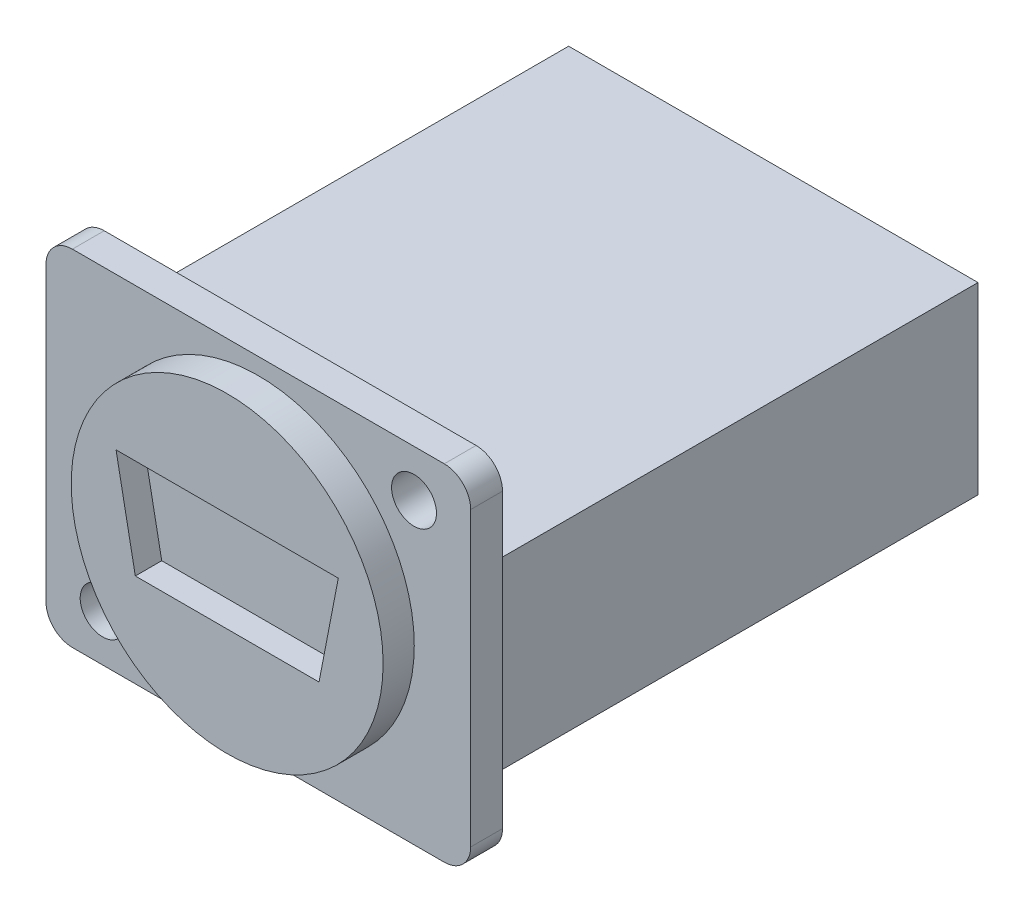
ISO-10303-21;
HEADER;
FILE_DESCRIPTION(('STEP AP214'),'2;1');
FILE_NAME('part.step','',(''),(''),'','','');
FILE_SCHEMA(('AUTOMOTIVE_DESIGN { 1 0 10303 214 1 1 1 1 }'));
ENDSEC;
DATA;
#1=APPLICATION_CONTEXT('core data for automotive mechanical design processes');
#2=APPLICATION_PROTOCOL_DEFINITION('international standard','automotive_design',2000,#1);
#3=PRODUCT_CONTEXT('',#1,'mechanical');
#4=PRODUCT('Part','Part','',(#3));
#5=PRODUCT_RELATED_PRODUCT_CATEGORY('part','',(#4));
#6=PRODUCT_DEFINITION_FORMATION('','',#4);
#7=PRODUCT_DEFINITION_CONTEXT('part definition',#1,'design');
#8=PRODUCT_DEFINITION('design','',#6,#7);
#9=PRODUCT_DEFINITION_SHAPE('','',#8);
#10=(LENGTH_UNIT() NAMED_UNIT(*) SI_UNIT(.MILLI.,.METRE.));
#11=(NAMED_UNIT(*) PLANE_ANGLE_UNIT() SI_UNIT($,.RADIAN.));
#12=(NAMED_UNIT(*) SI_UNIT($,.STERADIAN.) SOLID_ANGLE_UNIT());
#13=UNCERTAINTY_MEASURE_WITH_UNIT(LENGTH_MEASURE(1.E-05),#10,'distance_accuracy_value','');
#14=(GEOMETRIC_REPRESENTATION_CONTEXT(3) GLOBAL_UNCERTAINTY_ASSIGNED_CONTEXT((#13)) GLOBAL_UNIT_ASSIGNED_CONTEXT((#10,
#11,#12)) REPRESENTATION_CONTEXT('',''));
#15=CARTESIAN_POINT('',(0.,0.,0.));
#16=DIRECTION('',(0.,0.,1.));
#17=DIRECTION('',(1.,0.,0.));
#18=AXIS2_PLACEMENT_3D('',#15,#16,#17);
#19=CARTESIAN_POINT('',(-14.08,-11.065,0.));
#20=DIRECTION('',(0.,0.,1.));
#21=DIRECTION('',(1.,0.,0.));
#22=AXIS2_PLACEMENT_3D('',#19,#20,#21);
#23=PLANE('',#22);
#24=CARTESIAN_POINT('',(-14.08,-11.065,0.));
#25=DIRECTION('',(0.,0.,1.));
#26=DIRECTION('',(1.,0.,0.));
#27=AXIS2_PLACEMENT_3D('',#24,#25,#26);
#28=CIRCLE('',#27,2.);
#29=CARTESIAN_POINT('',(-16.08,-11.065,0.));
#30=VERTEX_POINT('',#29);
#31=CARTESIAN_POINT('',(-14.08,-13.065,0.));
#32=VERTEX_POINT('',#31);
#33=EDGE_CURVE('E224',#30,#32,#28,.T.);
#34=ORIENTED_EDGE('',*,*,#33,.F.);
#35=DIRECTION('',(0.,-1.,0.));
#36=VECTOR('',#35,1.);
#37=CARTESIAN_POINT('',(-16.08,11.065,0.));
#38=LINE('',#37,#36);
#39=CARTESIAN_POINT('',(-16.08,11.065,0.));
#40=VERTEX_POINT('',#39);
#41=EDGE_CURVE('E230',#40,#30,#38,.T.);
#42=ORIENTED_EDGE('',*,*,#41,.F.);
#43=CARTESIAN_POINT('',(-14.08,11.065,0.));
#44=DIRECTION('',(0.,0.,1.));
#45=DIRECTION('',(1.,0.,0.));
#46=AXIS2_PLACEMENT_3D('',#43,#44,#45);
#47=CIRCLE('',#46,2.);
#48=CARTESIAN_POINT('',(-14.08,13.065,0.));
#49=VERTEX_POINT('',#48);
#50=EDGE_CURVE('E257',#49,#40,#47,.T.);
#51=ORIENTED_EDGE('',*,*,#50,.F.);
#52=DIRECTION('',(-1.,0.,0.));
#53=VECTOR('',#52,1.);
#54=CARTESIAN_POINT('',(-14.08,13.065,0.));
#55=LINE('',#54,#53);
#56=CARTESIAN_POINT('',(14.08,13.065,0.));
#57=VERTEX_POINT('',#56);
#58=EDGE_CURVE('E255',#57,#49,#55,.T.);
#59=ORIENTED_EDGE('',*,*,#58,.F.);
#60=CARTESIAN_POINT('',(14.08,11.065,0.));
#61=DIRECTION('',(0.,0.,1.));
#62=DIRECTION('',(-1.,0.,0.));
#63=AXIS2_PLACEMENT_3D('',#60,#61,#62);
#64=CIRCLE('',#63,2.);
#65=CARTESIAN_POINT('',(16.08,11.065,0.));
#66=VERTEX_POINT('',#65);
#67=EDGE_CURVE('E253',#66,#57,#64,.T.);
#68=ORIENTED_EDGE('',*,*,#67,.F.);
#69=DIRECTION('',(0.,1.,0.));
#70=VECTOR('',#69,1.);
#71=CARTESIAN_POINT('',(16.08,11.065,0.));
#72=LINE('',#71,#70);
#73=CARTESIAN_POINT('',(16.08,-11.065,0.));
#74=VERTEX_POINT('',#73);
#75=EDGE_CURVE('E251',#74,#66,#72,.T.);
#76=ORIENTED_EDGE('',*,*,#75,.F.);
#77=CARTESIAN_POINT('',(14.08,-11.065,0.));
#78=DIRECTION('',(0.,0.,1.));
#79=DIRECTION('',(1.,0.,0.));
#80=AXIS2_PLACEMENT_3D('',#77,#78,#79);
#81=CIRCLE('',#80,2.);
#82=CARTESIAN_POINT('',(14.08,-13.065,0.));
#83=VERTEX_POINT('',#82);
#84=EDGE_CURVE('E249',#83,#74,#81,.T.);
#85=ORIENTED_EDGE('',*,*,#84,.F.);
#86=DIRECTION('',(1.,0.,0.));
#87=VECTOR('',#86,1.);
#88=CARTESIAN_POINT('',(-14.08,-13.065,0.));
#89=LINE('',#88,#87);
#90=EDGE_CURVE('E247',#32,#83,#89,.T.);
#91=ORIENTED_EDGE('',*,*,#90,.F.);
#92=EDGE_LOOP('',(#34,#42,#51,#59,#68,#76,#85,#91));
#93=FACE_BOUND('',#92,.T.);
#94=CARTESIAN_POINT('',(-11.79,-9.525,0.));
#95=DIRECTION('',(0.,0.,1.));
#96=DIRECTION('',(1.,0.,0.));
#97=AXIS2_PLACEMENT_3D('',#94,#95,#96);
#98=CIRCLE('',#97,1.7);
#99=CARTESIAN_POINT('',(-10.09,-9.525,0.));
#100=VERTEX_POINT('',#99);
#101=EDGE_CURVE('E204',#100,#100,#98,.T.);
#102=ORIENTED_EDGE('',*,*,#101,.T.);
#103=EDGE_LOOP('',(#102));
#104=FACE_BOUND('',#103,.T.);
#105=CARTESIAN_POINT('',(11.79,9.525,0.));
#106=DIRECTION('',(0.,0.,1.));
#107=DIRECTION('',(1.,0.,0.));
#108=AXIS2_PLACEMENT_3D('',#105,#106,#107);
#109=CIRCLE('',#108,1.7);
#110=CARTESIAN_POINT('',(13.49,9.525,0.));
#111=VERTEX_POINT('',#110);
#112=EDGE_CURVE('E211',#111,#111,#109,.T.);
#113=ORIENTED_EDGE('',*,*,#112,.T.);
#114=EDGE_LOOP('',(#113));
#115=FACE_BOUND('',#114,.T.);
#116=DIRECTION('',(0.,-1.,0.));
#117=VECTOR('',#116,1.);
#118=CARTESIAN_POINT('',(15.5,-7.765,0.));
#119=LINE('',#118,#117);
#120=CARTESIAN_POINT('',(15.5,6.165,0.));
#121=VERTEX_POINT('',#120);
#122=CARTESIAN_POINT('',(15.5,-7.765,0.));
#123=VERTEX_POINT('',#122);
#124=EDGE_CURVE('E55',#121,#123,#119,.T.);
#125=ORIENTED_EDGE('',*,*,#124,.F.);
#126=DIRECTION('',(1.,0.,0.));
#127=VECTOR('',#126,1.);
#128=CARTESIAN_POINT('',(-15.5,6.165,0.));
#129=LINE('',#128,#127);
#130=CARTESIAN_POINT('',(-15.5,6.165,0.));
#131=VERTEX_POINT('',#130);
#132=EDGE_CURVE('E59',#131,#121,#129,.T.);
#133=ORIENTED_EDGE('',*,*,#132,.F.);
#134=DIRECTION('',(0.,1.,0.));
#135=VECTOR('',#134,1.);
#136=CARTESIAN_POINT('',(-15.5,-7.765,0.));
#137=LINE('',#136,#135);
#138=CARTESIAN_POINT('',(-15.5,-7.765,0.));
#139=VERTEX_POINT('',#138);
#140=EDGE_CURVE('E584',#139,#131,#137,.T.);
#141=ORIENTED_EDGE('',*,*,#140,.F.);
#142=DIRECTION('',(-1.,0.,0.));
#143=VECTOR('',#142,1.);
#144=CARTESIAN_POINT('',(-15.5,-7.765,0.));
#145=LINE('',#144,#143);
#146=EDGE_CURVE('E590',#123,#139,#145,.T.);
#147=ORIENTED_EDGE('',*,*,#146,.F.);
#148=EDGE_LOOP('',(#125,#133,#141,#147));
#149=FACE_BOUND('',#148,.T.);
#150=ADVANCED_FACE('F39',(#93,#104,#115,#149),#23,.F.);
#151=CARTESIAN_POINT('',(-14.08,-11.065,2.41));
#152=DIRECTION('',(0.,0.,-1.));
#153=DIRECTION('',(-1.,0.,0.));
#154=AXIS2_PLACEMENT_3D('',#151,#152,#153);
#155=CYLINDRICAL_SURFACE('',#154,2.);
#156=ORIENTED_EDGE('',*,*,#33,.T.);
#157=DIRECTION('',(0.,0.,-1.));
#158=VECTOR('',#157,1.);
#159=CARTESIAN_POINT('',(-14.08,-13.065,2.41));
#160=LINE('',#159,#158);
#161=CARTESIAN_POINT('',(-14.08,-13.065,2.41));
#162=VERTEX_POINT('',#161);
#163=EDGE_CURVE('E43',#162,#32,#160,.T.);
#164=ORIENTED_EDGE('',*,*,#163,.F.);
#165=CARTESIAN_POINT('',(-14.08,-11.065,2.41));
#166=DIRECTION('',(0.,0.,1.));
#167=DIRECTION('',(1.,0.,0.));
#168=AXIS2_PLACEMENT_3D('',#165,#166,#167);
#169=CIRCLE('',#168,2.);
#170=CARTESIAN_POINT('',(-16.08,-11.065,2.41));
#171=VERTEX_POINT('',#170);
#172=EDGE_CURVE('E226',#171,#162,#169,.T.);
#173=ORIENTED_EDGE('',*,*,#172,.F.);
#174=DIRECTION('',(0.,0.,-1.));
#175=VECTOR('',#174,1.);
#176=CARTESIAN_POINT('',(-16.08,-11.065,2.41));
#177=LINE('',#176,#175);
#178=EDGE_CURVE('E244',#171,#30,#177,.T.);
#179=ORIENTED_EDGE('',*,*,#178,.T.);
#180=EDGE_LOOP('',(#156,#164,#173,#179));
#181=FACE_BOUND('',#180,.T.);
#182=ADVANCED_FACE('F41',(#181),#155,.T.);
#183=CARTESIAN_POINT('',(-14.08,-13.065,2.41));
#184=DIRECTION('',(0.,1.,0.));
#185=DIRECTION('',(0.,0.,1.));
#186=AXIS2_PLACEMENT_3D('',#183,#184,#185);
#187=PLANE('',#186);
#188=ORIENTED_EDGE('',*,*,#90,.T.);
#189=DIRECTION('',(0.,0.,-1.));
#190=VECTOR('',#189,1.);
#191=CARTESIAN_POINT('',(14.08,-13.065,2.41));
#192=LINE('',#191,#190);
#193=CARTESIAN_POINT('',(14.08,-13.065,2.41));
#194=VERTEX_POINT('',#193);
#195=EDGE_CURVE('E276',#194,#83,#192,.T.);
#196=ORIENTED_EDGE('',*,*,#195,.F.);
#197=DIRECTION('',(1.,0.,0.));
#198=VECTOR('',#197,1.);
#199=CARTESIAN_POINT('',(-14.08,-13.065,2.41));
#200=LINE('',#199,#198);
#201=EDGE_CURVE('E229',#162,#194,#200,.T.);
#202=ORIENTED_EDGE('',*,*,#201,.F.);
#203=ORIENTED_EDGE('',*,*,#163,.T.);
#204=EDGE_LOOP('',(#188,#196,#202,#203));
#205=FACE_BOUND('',#204,.T.);
#206=ADVANCED_FACE('F285',(#205),#187,.F.);
#207=CARTESIAN_POINT('',(14.08,-11.065,2.41));
#208=DIRECTION('',(0.,0.,-1.));
#209=DIRECTION('',(-1.,0.,0.));
#210=AXIS2_PLACEMENT_3D('',#207,#208,#209);
#211=CYLINDRICAL_SURFACE('',#210,2.);
#212=ORIENTED_EDGE('',*,*,#84,.T.);
#213=DIRECTION('',(0.,0.,-1.));
#214=VECTOR('',#213,1.);
#215=CARTESIAN_POINT('',(16.08,-11.065,2.41));
#216=LINE('',#215,#214);
#217=CARTESIAN_POINT('',(16.08,-11.065,2.41));
#218=VERTEX_POINT('',#217);
#219=EDGE_CURVE('E274',#218,#74,#216,.T.);
#220=ORIENTED_EDGE('',*,*,#219,.F.);
#221=CARTESIAN_POINT('',(14.08,-11.065,2.41));
#222=DIRECTION('',(0.,0.,1.));
#223=DIRECTION('',(1.,0.,0.));
#224=AXIS2_PLACEMENT_3D('',#221,#222,#223);
#225=CIRCLE('',#224,2.);
#226=EDGE_CURVE('E232',#194,#218,#225,.T.);
#227=ORIENTED_EDGE('',*,*,#226,.F.);
#228=ORIENTED_EDGE('',*,*,#195,.T.);
#229=EDGE_LOOP('',(#212,#220,#227,#228));
#230=FACE_BOUND('',#229,.T.);
#231=ADVANCED_FACE('F297',(#230),#211,.T.);
#232=CARTESIAN_POINT('',(16.08,11.065,2.41));
#233=DIRECTION('',(-1.,0.,0.));
#234=DIRECTION('',(0.,-1.,0.));
#235=AXIS2_PLACEMENT_3D('',#232,#233,#234);
#236=PLANE('',#235);
#237=ORIENTED_EDGE('',*,*,#75,.T.);
#238=DIRECTION('',(0.,0.,-1.));
#239=VECTOR('',#238,1.);
#240=CARTESIAN_POINT('',(16.08,11.065,2.41));
#241=LINE('',#240,#239);
#242=CARTESIAN_POINT('',(16.08,11.065,2.41));
#243=VERTEX_POINT('',#242);
#244=EDGE_CURVE('E271',#243,#66,#241,.T.);
#245=ORIENTED_EDGE('',*,*,#244,.F.);
#246=DIRECTION('',(0.,1.,0.));
#247=VECTOR('',#246,1.);
#248=CARTESIAN_POINT('',(16.08,11.065,2.41));
#249=LINE('',#248,#247);
#250=EDGE_CURVE('E234',#218,#243,#249,.T.);
#251=ORIENTED_EDGE('',*,*,#250,.F.);
#252=ORIENTED_EDGE('',*,*,#219,.T.);
#253=EDGE_LOOP('',(#237,#245,#251,#252));
#254=FACE_BOUND('',#253,.T.);
#255=ADVANCED_FACE('F300',(#254),#236,.F.);
#256=CARTESIAN_POINT('',(14.08,11.065,2.41));
#257=DIRECTION('',(0.,0.,-1.));
#258=DIRECTION('',(-1.,0.,0.));
#259=AXIS2_PLACEMENT_3D('',#256,#257,#258);
#260=CYLINDRICAL_SURFACE('',#259,2.);
#261=ORIENTED_EDGE('',*,*,#67,.T.);
#262=DIRECTION('',(0.,0.,-1.));
#263=VECTOR('',#262,1.);
#264=CARTESIAN_POINT('',(14.08,13.065,2.41));
#265=LINE('',#264,#263);
#266=CARTESIAN_POINT('',(14.08,13.065,2.41));
#267=VERTEX_POINT('',#266);
#268=EDGE_CURVE('E268',#267,#57,#265,.T.);
#269=ORIENTED_EDGE('',*,*,#268,.F.);
#270=CARTESIAN_POINT('',(14.08,11.065,2.41));
#271=DIRECTION('',(0.,0.,1.));
#272=DIRECTION('',(-1.,0.,0.));
#273=AXIS2_PLACEMENT_3D('',#270,#271,#272);
#274=CIRCLE('',#273,2.);
#275=EDGE_CURVE('E236',#243,#267,#274,.T.);
#276=ORIENTED_EDGE('',*,*,#275,.F.);
#277=ORIENTED_EDGE('',*,*,#244,.T.);
#278=EDGE_LOOP('',(#261,#269,#276,#277));
#279=FACE_BOUND('',#278,.T.);
#280=ADVANCED_FACE('F319',(#279),#260,.T.);
#281=CARTESIAN_POINT('',(-14.08,13.065,2.41));
#282=DIRECTION('',(0.,-1.,0.));
#283=DIRECTION('',(0.,0.,-1.));
#284=AXIS2_PLACEMENT_3D('',#281,#282,#283);
#285=PLANE('',#284);
#286=ORIENTED_EDGE('',*,*,#58,.T.);
#287=DIRECTION('',(0.,0.,-1.));
#288=VECTOR('',#287,1.);
#289=CARTESIAN_POINT('',(-14.08,13.065,2.41));
#290=LINE('',#289,#288);
#291=CARTESIAN_POINT('',(-14.08,13.065,2.41));
#292=VERTEX_POINT('',#291);
#293=EDGE_CURVE('E265',#292,#49,#290,.T.);
#294=ORIENTED_EDGE('',*,*,#293,.F.);
#295=DIRECTION('',(-1.,0.,0.));
#296=VECTOR('',#295,1.);
#297=CARTESIAN_POINT('',(-14.08,13.065,2.41));
#298=LINE('',#297,#296);
#299=EDGE_CURVE('E238',#267,#292,#298,.T.);
#300=ORIENTED_EDGE('',*,*,#299,.F.);
#301=ORIENTED_EDGE('',*,*,#268,.T.);
#302=EDGE_LOOP('',(#286,#294,#300,#301));
#303=FACE_BOUND('',#302,.T.);
#304=ADVANCED_FACE('F316',(#303),#285,.F.);
#305=CARTESIAN_POINT('',(-14.08,11.065,2.41));
#306=DIRECTION('',(0.,0.,-1.));
#307=DIRECTION('',(-1.,0.,0.));
#308=AXIS2_PLACEMENT_3D('',#305,#306,#307);
#309=CYLINDRICAL_SURFACE('',#308,2.);
#310=ORIENTED_EDGE('',*,*,#50,.T.);
#311=DIRECTION('',(0.,0.,-1.));
#312=VECTOR('',#311,1.);
#313=CARTESIAN_POINT('',(-16.08,11.065,2.41));
#314=LINE('',#313,#312);
#315=CARTESIAN_POINT('',(-16.08,11.065,2.41));
#316=VERTEX_POINT('',#315);
#317=EDGE_CURVE('E262',#316,#40,#314,.T.);
#318=ORIENTED_EDGE('',*,*,#317,.F.);
#319=CARTESIAN_POINT('',(-14.08,11.065,2.41));
#320=DIRECTION('',(0.,0.,1.));
#321=DIRECTION('',(1.,0.,0.));
#322=AXIS2_PLACEMENT_3D('',#319,#320,#321);
#323=CIRCLE('',#322,2.);
#324=EDGE_CURVE('E240',#292,#316,#323,.T.);
#325=ORIENTED_EDGE('',*,*,#324,.F.);
#326=ORIENTED_EDGE('',*,*,#293,.T.);
#327=EDGE_LOOP('',(#310,#318,#325,#326));
#328=FACE_BOUND('',#327,.T.);
#329=ADVANCED_FACE('F312',(#328),#309,.T.);
#330=CARTESIAN_POINT('',(-16.08,11.065,2.41));
#331=DIRECTION('',(1.,0.,0.));
#332=DIRECTION('',(0.,1.,0.));
#333=AXIS2_PLACEMENT_3D('',#330,#331,#332);
#334=PLANE('',#333);
#335=ORIENTED_EDGE('',*,*,#41,.T.);
#336=ORIENTED_EDGE('',*,*,#178,.F.);
#337=DIRECTION('',(0.,-1.,0.));
#338=VECTOR('',#337,1.);
#339=CARTESIAN_POINT('',(-16.08,11.065,2.41));
#340=LINE('',#339,#338);
#341=EDGE_CURVE('E242',#316,#171,#340,.T.);
#342=ORIENTED_EDGE('',*,*,#341,.F.);
#343=ORIENTED_EDGE('',*,*,#317,.T.);
#344=EDGE_LOOP('',(#335,#336,#342,#343));
#345=FACE_BOUND('',#344,.T.);
#346=ADVANCED_FACE('F310',(#345),#334,.F.);
#347=CARTESIAN_POINT('',(-14.08,-11.065,2.41));
#348=DIRECTION('',(0.,0.,1.));
#349=DIRECTION('',(1.,0.,0.));
#350=AXIS2_PLACEMENT_3D('',#347,#348,#349);
#351=PLANE('',#350);
#352=CARTESIAN_POINT('',(11.79,9.525,2.41));
#353=DIRECTION('',(0.,0.,1.));
#354=DIRECTION('',(1.,0.,0.));
#355=AXIS2_PLACEMENT_3D('',#352,#353,#354);
#356=CIRCLE('',#355,1.7);
#357=CARTESIAN_POINT('',(13.49,9.525,2.41));
#358=VERTEX_POINT('',#357);
#359=EDGE_CURVE('E215',#358,#358,#356,.T.);
#360=ORIENTED_EDGE('',*,*,#359,.F.);
#361=EDGE_LOOP('',(#360));
#362=FACE_BOUND('',#361,.T.);
#363=CARTESIAN_POINT('',(-11.79,-9.525,2.41));
#364=DIRECTION('',(0.,0.,1.));
#365=DIRECTION('',(1.,0.,0.));
#366=AXIS2_PLACEMENT_3D('',#363,#364,#365);
#367=CIRCLE('',#366,1.7);
#368=CARTESIAN_POINT('',(-10.09,-9.525,2.41));
#369=VERTEX_POINT('',#368);
#370=EDGE_CURVE('E218',#369,#369,#367,.T.);
#371=ORIENTED_EDGE('',*,*,#370,.F.);
#372=EDGE_LOOP('',(#371));
#373=FACE_BOUND('',#372,.T.);
#374=CARTESIAN_POINT('',(0.,0.,2.41));
#375=DIRECTION('',(0.,0.,1.));
#376=DIRECTION('',(1.,0.,0.));
#377=AXIS2_PLACEMENT_3D('',#374,#375,#376);
#378=CIRCLE('',#377,11.81);
#379=CARTESIAN_POINT('',(11.81,0.,2.41));
#380=VERTEX_POINT('',#379);
#381=EDGE_CURVE('E11',#380,#380,#378,.T.);
#382=ORIENTED_EDGE('',*,*,#381,.F.);
#383=EDGE_LOOP('',(#382));
#384=FACE_BOUND('',#383,.T.);
#385=ORIENTED_EDGE('',*,*,#172,.T.);
#386=ORIENTED_EDGE('',*,*,#201,.T.);
#387=ORIENTED_EDGE('',*,*,#226,.T.);
#388=ORIENTED_EDGE('',*,*,#250,.T.);
#389=ORIENTED_EDGE('',*,*,#275,.T.);
#390=ORIENTED_EDGE('',*,*,#299,.T.);
#391=ORIENTED_EDGE('',*,*,#324,.T.);
#392=ORIENTED_EDGE('',*,*,#341,.T.);
#393=EDGE_LOOP('',(#385,#386,#387,#388,#389,#390,#391,#392));
#394=FACE_BOUND('',#393,.T.);
#395=ADVANCED_FACE('F304',(#362,#373,#384,#394),#351,.T.);
#396=CARTESIAN_POINT('',(0.,0.,4.77));
#397=DIRECTION('',(0.,0.,-1.));
#398=DIRECTION('',(-1.,0.,0.));
#399=AXIS2_PLACEMENT_3D('',#396,#397,#398);
#400=CYLINDRICAL_SURFACE('',#399,11.81);
#401=CARTESIAN_POINT('',(0.,0.,4.77));
#402=DIRECTION('',(0.,0.,1.));
#403=DIRECTION('',(1.,0.,0.));
#404=AXIS2_PLACEMENT_3D('',#401,#402,#403);
#405=CIRCLE('',#404,11.81);
#406=CARTESIAN_POINT('',(11.81,0.,4.77));
#407=VERTEX_POINT('',#406);
#408=EDGE_CURVE('E214',#407,#407,#405,.T.);
#409=ORIENTED_EDGE('',*,*,#408,.F.);
#410=EDGE_LOOP('',(#409));
#411=FACE_BOUND('',#410,.T.);
#412=ORIENTED_EDGE('',*,*,#381,.T.);
#413=EDGE_LOOP('',(#412));
#414=FACE_BOUND('',#413,.T.);
#415=ADVANCED_FACE('F354',(#411,#414),#400,.T.);
#416=CARTESIAN_POINT('',(0.,0.,4.77));
#417=DIRECTION('',(0.,0.,1.));
#418=DIRECTION('',(1.,0.,0.));
#419=AXIS2_PLACEMENT_3D('',#416,#417,#418);
#420=PLANE('',#419);
#421=DIRECTION('',(0.190021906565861,0.981779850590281,0.));
#422=VECTOR('',#421,1.);
#423=CARTESIAN_POINT('',(8.41590864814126,3.91390450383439,4.77));
#424=LINE('',#423,#422);
#425=CARTESIAN_POINT('',(6.95579919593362,-3.62999433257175,4.77));
#426=VERTEX_POINT('',#425);
#427=CARTESIAN_POINT('',(8.41590864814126,3.91390450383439,4.77));
#428=VERTEX_POINT('',#427);
#429=EDGE_CURVE('E173',#426,#428,#424,.T.);
#430=ORIENTED_EDGE('',*,*,#429,.F.);
#431=DIRECTION('',(1.,0.,0.));
#432=VECTOR('',#431,1.);
#433=CARTESIAN_POINT('',(6.95579919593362,-3.62999433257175,4.77));
#434=LINE('',#433,#432);
#435=CARTESIAN_POINT('',(-6.95579919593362,-3.62999433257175,4.77));
#436=VERTEX_POINT('',#435);
#437=EDGE_CURVE('E185',#436,#426,#434,.T.);
#438=ORIENTED_EDGE('',*,*,#437,.F.);
#439=DIRECTION('',(0.190021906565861,-0.981779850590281,0.));
#440=VECTOR('',#439,1.);
#441=CARTESIAN_POINT('',(-8.41590864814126,3.91390450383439,4.77));
#442=LINE('',#441,#440);
#443=CARTESIAN_POINT('',(-8.41590864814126,3.91390450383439,4.77));
#444=VERTEX_POINT('',#443);
#445=EDGE_CURVE('E197',#444,#436,#442,.T.);
#446=ORIENTED_EDGE('',*,*,#445,.F.);
#447=DIRECTION('',(-1.,0.,0.));
#448=VECTOR('',#447,1.);
#449=CARTESIAN_POINT('',(-8.41590864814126,3.91390450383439,4.77));
#450=LINE('',#449,#448);
#451=EDGE_CURVE('E175',#428,#444,#450,.T.);
#452=ORIENTED_EDGE('',*,*,#451,.F.);
#453=EDGE_LOOP('',(#430,#438,#446,#452));
#454=FACE_BOUND('',#453,.T.);
#455=ORIENTED_EDGE('',*,*,#408,.T.);
#456=EDGE_LOOP('',(#455));
#457=FACE_BOUND('',#456,.T.);
#458=ADVANCED_FACE('F361',(#454,#457),#420,.T.);
#459=CARTESIAN_POINT('',(-11.79,-9.525,0.));
#460=DIRECTION('',(0.,0.,1.));
#461=DIRECTION('',(1.,0.,0.));
#462=AXIS2_PLACEMENT_3D('',#459,#460,#461);
#463=CYLINDRICAL_SURFACE('',#462,1.7);
#464=ORIENTED_EDGE('',*,*,#101,.F.);
#465=EDGE_LOOP('',(#464));
#466=FACE_BOUND('',#465,.T.);
#467=ORIENTED_EDGE('',*,*,#370,.T.);
#468=EDGE_LOOP('',(#467));
#469=FACE_BOUND('',#468,.T.);
#470=ADVANCED_FACE('F368',(#466,#469),#463,.F.);
#471=CARTESIAN_POINT('',(11.79,9.525,0.));
#472=DIRECTION('',(0.,0.,1.));
#473=DIRECTION('',(1.,0.,0.));
#474=AXIS2_PLACEMENT_3D('',#471,#472,#473);
#475=CYLINDRICAL_SURFACE('',#474,1.7);
#476=ORIENTED_EDGE('',*,*,#112,.F.);
#477=EDGE_LOOP('',(#476));
#478=FACE_BOUND('',#477,.T.);
#479=ORIENTED_EDGE('',*,*,#359,.T.);
#480=EDGE_LOOP('',(#479));
#481=FACE_BOUND('',#480,.T.);
#482=ADVANCED_FACE('F377',(#478,#481),#475,.F.);
#483=CARTESIAN_POINT('',(8.41590864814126,3.91390450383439,2.77));
#484=DIRECTION('',(0.981779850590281,-0.190021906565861,0.));
#485=DIRECTION('',(0.190021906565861,0.981779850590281,0.));
#486=AXIS2_PLACEMENT_3D('',#483,#484,#485);
#487=PLANE('',#486);
#488=ORIENTED_EDGE('',*,*,#429,.T.);
#489=DIRECTION('',(0.,0.,1.));
#490=VECTOR('',#489,1.);
#491=CARTESIAN_POINT('',(8.41590864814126,3.91390450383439,2.77));
#492=LINE('',#491,#490);
#493=CARTESIAN_POINT('',(8.41590864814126,3.91390450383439,2.77));
#494=VERTEX_POINT('',#493);
#495=EDGE_CURVE('E193',#494,#428,#492,.T.);
#496=ORIENTED_EDGE('',*,*,#495,.F.);
#497=DIRECTION('',(0.190021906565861,0.981779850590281,0.));
#498=VECTOR('',#497,1.);
#499=CARTESIAN_POINT('',(8.41590864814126,3.91390450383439,2.77));
#500=LINE('',#499,#498);
#501=CARTESIAN_POINT('',(6.95579919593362,-3.62999433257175,2.77));
#502=VERTEX_POINT('',#501);
#503=EDGE_CURVE('E181',#502,#494,#500,.T.);
#504=ORIENTED_EDGE('',*,*,#503,.F.);
#505=DIRECTION('',(0.,0.,1.));
#506=VECTOR('',#505,1.);
#507=CARTESIAN_POINT('',(6.95579919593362,-3.62999433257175,2.77));
#508=LINE('',#507,#506);
#509=EDGE_CURVE('E202',#502,#426,#508,.T.);
#510=ORIENTED_EDGE('',*,*,#509,.T.);
#511=EDGE_LOOP('',(#488,#496,#504,#510));
#512=FACE_BOUND('',#511,.T.);
#513=ADVANCED_FACE('F384',(#512),#487,.F.);
#514=CARTESIAN_POINT('',(6.95579919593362,-3.62999433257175,2.77));
#515=DIRECTION('',(0.,-1.,0.));
#516=DIRECTION('',(0.,0.,-1.));
#517=AXIS2_PLACEMENT_3D('',#514,#515,#516);
#518=PLANE('',#517);
#519=ORIENTED_EDGE('',*,*,#437,.T.);
#520=ORIENTED_EDGE('',*,*,#509,.F.);
#521=DIRECTION('',(1.,0.,0.));
#522=VECTOR('',#521,1.);
#523=CARTESIAN_POINT('',(6.95579919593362,-3.62999433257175,2.77));
#524=LINE('',#523,#522);
#525=CARTESIAN_POINT('',(-6.95579919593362,-3.62999433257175,2.77));
#526=VERTEX_POINT('',#525);
#527=EDGE_CURVE('E191',#526,#502,#524,.T.);
#528=ORIENTED_EDGE('',*,*,#527,.F.);
#529=DIRECTION('',(0.,0.,1.));
#530=VECTOR('',#529,1.);
#531=CARTESIAN_POINT('',(-6.95579919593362,-3.62999433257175,2.77));
#532=LINE('',#531,#530);
#533=EDGE_CURVE('E205',#526,#436,#532,.T.);
#534=ORIENTED_EDGE('',*,*,#533,.T.);
#535=EDGE_LOOP('',(#519,#520,#528,#534));
#536=FACE_BOUND('',#535,.T.);
#537=ADVANCED_FACE('F391',(#536),#518,.F.);
#538=CARTESIAN_POINT('',(-8.41590864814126,3.91390450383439,2.77));
#539=DIRECTION('',(-0.981779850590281,-0.190021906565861,0.));
#540=DIRECTION('',(0.190021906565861,-0.981779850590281,0.));
#541=AXIS2_PLACEMENT_3D('',#538,#539,#540);
#542=PLANE('',#541);
#543=ORIENTED_EDGE('',*,*,#445,.T.);
#544=ORIENTED_EDGE('',*,*,#533,.F.);
#545=DIRECTION('',(0.190021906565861,-0.981779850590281,0.));
#546=VECTOR('',#545,1.);
#547=CARTESIAN_POINT('',(-8.41590864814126,3.91390450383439,2.77));
#548=LINE('',#547,#546);
#549=CARTESIAN_POINT('',(-8.41590864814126,3.91390450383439,2.77));
#550=VERTEX_POINT('',#549);
#551=EDGE_CURVE('E188',#550,#526,#548,.T.);
#552=ORIENTED_EDGE('',*,*,#551,.F.);
#553=DIRECTION('',(0.,0.,1.));
#554=VECTOR('',#553,1.);
#555=CARTESIAN_POINT('',(-8.41590864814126,3.91390450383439,2.77));
#556=LINE('',#555,#554);
#557=EDGE_CURVE('E207',#550,#444,#556,.T.);
#558=ORIENTED_EDGE('',*,*,#557,.T.);
#559=EDGE_LOOP('',(#543,#544,#552,#558));
#560=FACE_BOUND('',#559,.T.);
#561=ADVANCED_FACE('F399',(#560),#542,.F.);
#562=CARTESIAN_POINT('',(-8.41590864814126,3.91390450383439,2.77));
#563=DIRECTION('',(0.,1.,0.));
#564=DIRECTION('',(0.,0.,1.));
#565=AXIS2_PLACEMENT_3D('',#562,#563,#564);
#566=PLANE('',#565);
#567=ORIENTED_EDGE('',*,*,#451,.T.);
#568=ORIENTED_EDGE('',*,*,#557,.F.);
#569=DIRECTION('',(-1.,0.,0.));
#570=VECTOR('',#569,1.);
#571=CARTESIAN_POINT('',(-8.41590864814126,3.91390450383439,2.77));
#572=LINE('',#571,#570);
#573=EDGE_CURVE('E184',#494,#550,#572,.T.);
#574=ORIENTED_EDGE('',*,*,#573,.F.);
#575=ORIENTED_EDGE('',*,*,#495,.T.);
#576=EDGE_LOOP('',(#567,#568,#574,#575));
#577=FACE_BOUND('',#576,.T.);
#578=ADVANCED_FACE('F407',(#577),#566,.F.);
#579=CARTESIAN_POINT('',(0.,0.,2.77));
#580=DIRECTION('',(0.,0.,-1.));
#581=DIRECTION('',(-1.,0.,0.));
#582=AXIS2_PLACEMENT_3D('',#579,#580,#581);
#583=PLANE('',#582);
#584=ORIENTED_EDGE('',*,*,#503,.T.);
#585=ORIENTED_EDGE('',*,*,#573,.T.);
#586=ORIENTED_EDGE('',*,*,#551,.T.);
#587=ORIENTED_EDGE('',*,*,#527,.T.);
#588=EDGE_LOOP('',(#584,#585,#586,#587));
#589=FACE_BOUND('',#588,.T.);
#590=ADVANCED_FACE('F415',(#589),#583,.F.);
#591=CARTESIAN_POINT('',(15.5,-7.765,-36.59));
#592=DIRECTION('',(-1.,0.,0.));
#593=DIRECTION('',(0.,0.,1.));
#594=AXIS2_PLACEMENT_3D('',#591,#592,#593);
#595=PLANE('',#594);
#596=ORIENTED_EDGE('',*,*,#124,.T.);
#597=DIRECTION('',(0.,0.,1.));
#598=VECTOR('',#597,1.);
#599=CARTESIAN_POINT('',(15.5,-7.765,-36.59));
#600=LINE('',#599,#598);
#601=CARTESIAN_POINT('',(15.5,-7.765,-36.59));
#602=VERTEX_POINT('',#601);
#603=EDGE_CURVE('E156',#602,#123,#600,.T.);
#604=ORIENTED_EDGE('',*,*,#603,.F.);
#605=DIRECTION('',(0.,-1.,0.));
#606=VECTOR('',#605,1.);
#607=CARTESIAN_POINT('',(15.5,-7.765,-36.59));
#608=LINE('',#607,#606);
#609=CARTESIAN_POINT('',(15.5,6.165,-36.59));
#610=VERTEX_POINT('',#609);
#611=EDGE_CURVE('E162',#610,#602,#608,.T.);
#612=ORIENTED_EDGE('',*,*,#611,.F.);
#613=DIRECTION('',(0.,0.,1.));
#614=VECTOR('',#613,1.);
#615=CARTESIAN_POINT('',(15.5,6.165,-36.59));
#616=LINE('',#615,#614);
#617=EDGE_CURVE('E582',#610,#121,#616,.T.);
#618=ORIENTED_EDGE('',*,*,#617,.T.);
#619=EDGE_LOOP('',(#596,#604,#612,#618));
#620=FACE_BOUND('',#619,.T.);
#621=ADVANCED_FACE('F172',(#620),#595,.F.);
#622=CARTESIAN_POINT('',(-15.5,-7.765,-36.59));
#623=DIRECTION('',(0.,1.,0.));
#624=DIRECTION('',(-1.,0.,0.));
#625=AXIS2_PLACEMENT_3D('',#622,#623,#624);
#626=PLANE('',#625);
#627=ORIENTED_EDGE('',*,*,#146,.T.);
#628=DIRECTION('',(0.,0.,1.));
#629=VECTOR('',#628,1.);
#630=CARTESIAN_POINT('',(-15.5,-7.765,-36.59));
#631=LINE('',#630,#629);
#632=CARTESIAN_POINT('',(-15.5,-7.765,-36.59));
#633=VERTEX_POINT('',#632);
#634=EDGE_CURVE('E158',#633,#139,#631,.T.);
#635=ORIENTED_EDGE('',*,*,#634,.F.);
#636=DIRECTION('',(-1.,0.,0.));
#637=VECTOR('',#636,1.);
#638=CARTESIAN_POINT('',(-15.5,-7.765,-36.59));
#639=LINE('',#638,#637);
#640=EDGE_CURVE('E151',#602,#633,#639,.T.);
#641=ORIENTED_EDGE('',*,*,#640,.F.);
#642=ORIENTED_EDGE('',*,*,#603,.T.);
#643=EDGE_LOOP('',(#627,#635,#641,#642));
#644=FACE_BOUND('',#643,.T.);
#645=ADVANCED_FACE('F154',(#644),#626,.F.);
#646=CARTESIAN_POINT('',(-15.5,-7.765,-36.59));
#647=DIRECTION('',(1.,0.,0.));
#648=DIRECTION('',(0.,0.,-1.));
#649=AXIS2_PLACEMENT_3D('',#646,#647,#648);
#650=PLANE('',#649);
#651=ORIENTED_EDGE('',*,*,#140,.T.);
#652=DIRECTION('',(0.,0.,1.));
#653=VECTOR('',#652,1.);
#654=CARTESIAN_POINT('',(-15.5,6.165,-36.59));
#655=LINE('',#654,#653);
#656=CARTESIAN_POINT('',(-15.5,6.165,-36.59));
#657=VERTEX_POINT('',#656);
#658=EDGE_CURVE('E177',#657,#131,#655,.T.);
#659=ORIENTED_EDGE('',*,*,#658,.F.);
#660=DIRECTION('',(0.,1.,0.));
#661=VECTOR('',#660,1.);
#662=CARTESIAN_POINT('',(-15.5,-7.765,-36.59));
#663=LINE('',#662,#661);
#664=EDGE_CURVE('E161',#633,#657,#663,.T.);
#665=ORIENTED_EDGE('',*,*,#664,.F.);
#666=ORIENTED_EDGE('',*,*,#634,.T.);
#667=EDGE_LOOP('',(#651,#659,#665,#666));
#668=FACE_BOUND('',#667,.T.);
#669=ADVANCED_FACE('F436',(#668),#650,.F.);
#670=CARTESIAN_POINT('',(-15.5,6.165,-36.59));
#671=DIRECTION('',(0.,-1.,0.));
#672=DIRECTION('',(1.,0.,0.));
#673=AXIS2_PLACEMENT_3D('',#670,#671,#672);
#674=PLANE('',#673);
#675=ORIENTED_EDGE('',*,*,#132,.T.);
#676=ORIENTED_EDGE('',*,*,#617,.F.);
#677=DIRECTION('',(1.,0.,0.));
#678=VECTOR('',#677,1.);
#679=CARTESIAN_POINT('',(-15.5,6.165,-36.59));
#680=LINE('',#679,#678);
#681=EDGE_CURVE('E167',#657,#610,#680,.T.);
#682=ORIENTED_EDGE('',*,*,#681,.F.);
#683=ORIENTED_EDGE('',*,*,#658,.T.);
#684=EDGE_LOOP('',(#675,#676,#682,#683));
#685=FACE_BOUND('',#684,.T.);
#686=ADVANCED_FACE('F443',(#685),#674,.F.);
#687=CARTESIAN_POINT('',(0.,0.,-36.59));
#688=DIRECTION('',(0.,0.,-1.));
#689=DIRECTION('',(-1.,0.,0.));
#690=AXIS2_PLACEMENT_3D('',#687,#688,#689);
#691=PLANE('',#690);
#692=ORIENTED_EDGE('',*,*,#611,.T.);
#693=ORIENTED_EDGE('',*,*,#640,.T.);
#694=ORIENTED_EDGE('',*,*,#664,.T.);
#695=ORIENTED_EDGE('',*,*,#681,.T.);
#696=EDGE_LOOP('',(#692,#693,#694,#695));
#697=FACE_BOUND('',#696,.T.);
#698=ADVANCED_FACE('F165',(#697),#691,.T.);
#699=CLOSED_SHELL('',(#150,#182,#206,#231,#255,#280,#304,#329,#346,#395,#415,#458,#470,#482,
#513,#537,#561,#578,#590,#621,#645,#669,#686,#698));
#700=MANIFOLD_SOLID_BREP('B2',#699);
#701=ADVANCED_BREP_SHAPE_REPRESENTATION('',(#18,#700),#14);
#702=SHAPE_DEFINITION_REPRESENTATION(#9,#701);
ENDSEC;
END-ISO-10303-21;
